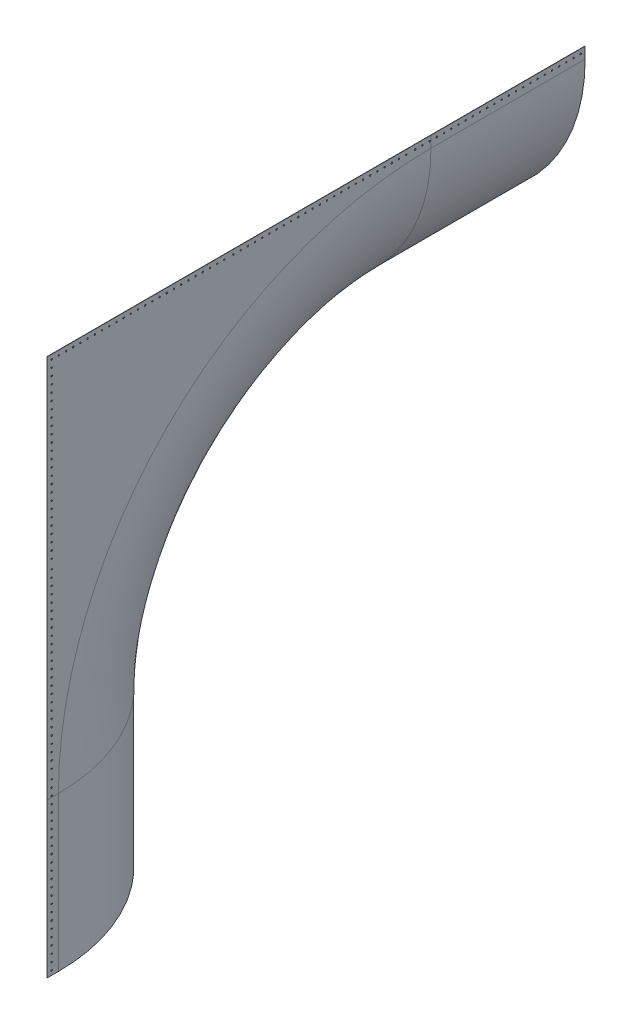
from build123d import *

# Parameters (mm, degrees)
BOSS_EXTRUDE1_DEPTH     = 1007.1377971
BOSS_EXTRUDE2_START     = -1.5875
BOSS_EXTRUDE2_DEPTH     = 1.5875
BOSS_EXTRUDE3_START     = 1006.9599971
BOSS_EXTRUDE3_DEPTH     = 1006.9599971
SKETCH11_R              = 4.826
CUT_EXTRUDE1_DEPTH      = 10
SKETCH13_W              = 4401.129844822
SKETCH13_H              = 2946.111508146
CUT_EXTRUDE2_DEPTH      = 4621.611456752
CUT_EXTRUDE3_DEPTH      = 4621.611456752
CUT_EXTRUDE3_DEPTH_BACK = 4621.611456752


with BuildPart() as part:
    # Sweep2: sweep along a path in Corner Arch
    with BuildLine(Plane.YZ) as sweep2_path:
        Line((0, 0), (0, 75.7422029))
        ThreePointArc((0, 75.7422029), (-731.881575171, 1842.660627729), (-2498.8, 2574.5422029))
        Line((-2498.8, 2574.5422029), (-2574.5422029, 2574.5422029))
    # sk 48.2in rad pnl → Sweep2 (sweep)
    with BuildSketch(Plane(origin=(0, 0, 0), x_dir=(0, 1, 0), z_dir=(0, 0, 1))):
        with BuildLine():
            Line((0, -1222.6925), (75.746594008, -1222.6925))
            Line((75.746594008, -1222.6925), (75.746594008, -1224.28))
            Line((75.746594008, -1224.28), (0, -1224.28))
            ThreePointArc((0, -1224.28), (-865.696690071, -865.696690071), (-1224.28, 0))
            Line((-1224.28, 0), (-1224.28, 75.737811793))
            Line((-1224.28, 75.737811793), (-1222.6925, 75.737811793))
            Line((-1222.6925, 75.737811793), (-1222.6925, 0))
            ThreePointArc((-1222.6925, 0), (-864.574158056, -864.574158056), (0, -1222.6925))
        make_face()
    sweep(path=sweep2_path.line)

    # Lower profile → Boss-Extrude1 (add)
    with BuildSketch(Plane(origin=(0, 0, 0), x_dir=(1, 0, 0), z_dir=(0, 0, -1))):
        with BuildLine():
            Line((-75.737811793, 1224.28), (0, 1224.28))
            ThreePointArc((0, 1224.28), (865.696690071, 865.696690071), (1224.28, 0))
            Line((1224.28, 0), (1224.28, -75.746594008))
            Line((1224.28, -75.746594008), (1222.6925, -75.746594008))
            Line((1222.6925, -75.746594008), (1222.6925, 0))
            ThreePointArc((1222.6925, 0), (864.574158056, 864.574158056), (0, 1222.6925))
            Line((0, 1222.6925), (-75.737811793, 1222.6925))
            Line((-75.737811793, 1222.6925), (-75.737811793, 1224.28))
        make_face()
    extrude(amount=BOSS_EXTRUDE1_DEPTH)

    # Sketch9 → Boss-Extrude2 (add)
    with BuildSketch(Plane.YZ.offset(1224.28).offset(BOSS_EXTRUDE2_START)):
        with BuildLine():
            Line((75.746594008, 75.7422029), (75.746594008, 2650.288796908))
            Line((75.746594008, 2650.288796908), (-2498.8, 2650.288796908))
            ThreePointArc((-2498.8, 2650.288796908), (-678.320644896, 1896.221558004), (75.746594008, 75.7422029))
        make_face()
    extrude(amount=BOSS_EXTRUDE2_DEPTH)

    # Sketch12 → Boss-Extrude3 (add)
    with BuildSketch(Plane.XZ.offset(2574.5422029).offset(BOSS_EXTRUDE3_START)):
        with BuildLine():
            Line((1224.28, 2650.288796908), (1224.28, 2574.5422029))
            ThreePointArc((1224.28, 2574.5422029), (865.696690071, 1708.845512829), (0, 1350.2622029))
            Line((0, 1350.2622029), (-75.737811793, 1350.2622029))
            Line((-75.737811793, 1350.2622029), (-75.737811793, 1351.8497029))
            Line((-75.737811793, 1351.8497029), (0, 1351.8497029))
            ThreePointArc((0, 1351.8497029), (864.574158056, 1709.968044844), (1222.6925, 2574.5422029))
            Line((1222.6925, 2574.5422029), (1222.6925, 2650.288796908))
            Line((1222.6925, 2650.288796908), (1224.28, 2650.288796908))
        make_face()
    extrude(amount=-BOSS_EXTRUDE3_DEPTH)

    # Sketch11 → Cut-Extrude1 (cut)
    with BuildSketch(Plane.YZ.offset(1224.28)):
        with Locations(Location((45.262199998, 1400.604402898, 0), (0, 0, 270))):
            Circle(SKETCH11_R)
        with Locations(Location((45.262199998, 1352.344402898, 0), (0, 0, 270))):
            Circle(SKETCH11_R)
        with Locations(Location((45.262199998, 1304.084402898, 0), (0, 0, 270))):
            Circle(SKETCH11_R)
        with Locations(Location((45.262199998, 1255.824402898, 0), (0, 0, 270))):
            Circle(SKETCH11_R)
        with Locations(Location((45.262199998, 1207.564402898, 0), (0, 0, 270))):
            Circle(SKETCH11_R)
        with Locations(Location((45.262199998, 1159.304402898, 0), (0, 0, 270))):
            Circle(SKETCH11_R)
        with Locations(Location((45.262199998, 1111.044402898, 0), (0, 0, 270))):
            Circle(SKETCH11_R)
        with Locations(Location((45.262199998, 1062.784402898, 0), (0, 0, 270))):
            Circle(SKETCH11_R)
        with Locations(Location((45.262199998, 1014.524402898, 0), (0, 0, 270))):
            Circle(SKETCH11_R)
        with Locations(Location((45.262199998, 966.264402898, 0), (0, 0, 270))):
            Circle(SKETCH11_R)
        with Locations(Location((45.262199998, 918.004402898, 0), (0, 0, 270))):
            Circle(SKETCH11_R)
        with Locations(Location((45.262199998, 869.744402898, 0), (0, 0, 270))):
            Circle(SKETCH11_R)
        with Locations(Location((45.262199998, 821.484402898, 0), (0, 0, 270))):
            Circle(SKETCH11_R)
        with Locations(Location((45.262199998, 773.224402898, 0), (0, 0, 270))):
            Circle(SKETCH11_R)
        with Locations(Location((45.262199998, 724.964402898, 0), (0, 0, 270))):
            Circle(SKETCH11_R)
        with Locations(Location((45.262199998, 676.704402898, 0), (0, 0, 270))):
            Circle(SKETCH11_R)
        with Locations(Location((45.262199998, 628.444402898, 0), (0, 0, 270))):
            Circle(SKETCH11_R)
        with Locations(Location((45.262199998, 580.184402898, 0), (0, 0, 270))):
            Circle(SKETCH11_R)
        with Locations(Location((45.262199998, 531.924402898, 0), (0, 0, 270))):
            Circle(SKETCH11_R)
        with Locations(Location((45.262199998, 483.664402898, 0), (0, 0, 270))):
            Circle(SKETCH11_R)
        with Locations(Location((45.262199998, 435.404402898, 0), (0, 0, 270))):
            Circle(SKETCH11_R)
        with Locations(Location((45.262199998, 387.144402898, 0), (0, 0, 270))):
            Circle(SKETCH11_R)
        with Locations(Location((45.262199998, 338.884402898, 0), (0, 0, 270))):
            Circle(SKETCH11_R)
        with Locations(Location((45.262199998, 290.624402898, 0), (0, 0, 270))):
            Circle(SKETCH11_R)
        with Locations(Location((45.262199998, 242.364402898, 0), (0, 0, 270))):
            Circle(SKETCH11_R)
        with Locations(Location((-1173.937800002, 2619.804402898, 0), (0, 0, 270))):
            Circle(SKETCH11_R)
        with Locations(Location((-1222.197800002, 2619.804402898, 0), (0, 0, 270))):
            Circle(SKETCH11_R)
        with Locations(Location((-1270.457800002, 2619.804402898, 0), (0, 0, 270))):
            Circle(SKETCH11_R)
        with Locations(Location((-1318.717800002, 2619.804402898, 0), (0, 0, 270))):
            Circle(SKETCH11_R)
        with Locations(Location((-1366.977800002, 2619.804402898, 0), (0, 0, 270))):
            Circle(SKETCH11_R)
        with Locations(Location((-1415.237800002, 2619.804402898, 0), (0, 0, 270))):
            Circle(SKETCH11_R)
        with Locations(Location((-1463.497800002, 2619.804402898, 0), (0, 0, 270))):
            Circle(SKETCH11_R)
        with Locations(Location((-1511.757800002, 2619.804402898, 0), (0, 0, 270))):
            Circle(SKETCH11_R)
        with Locations(Location((-1560.017800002, 2619.804402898, 0), (0, 0, 270))):
            Circle(SKETCH11_R)
        with Locations(Location((-1608.277800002, 2619.804402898, 0), (0, 0, 270))):
            Circle(SKETCH11_R)
        with Locations(Location((-1656.537800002, 2619.804402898, 0), (0, 0, 270))):
            Circle(SKETCH11_R)
        with Locations(Location((-1704.797800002, 2619.804402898, 0), (0, 0, 270))):
            Circle(SKETCH11_R)
        with Locations(Location((-1753.057800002, 2619.804402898, 0), (0, 0, 270))):
            Circle(SKETCH11_R)
        with Locations(Location((-1801.317800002, 2619.804402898, 0), (0, 0, 270))):
            Circle(SKETCH11_R)
        with Locations(Location((-1849.577800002, 2619.804402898, 0), (0, 0, 270))):
            Circle(SKETCH11_R)
        with Locations(Location((-1897.837800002, 2619.804402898, 0), (0, 0, 270))):
            Circle(SKETCH11_R)
        with Locations(Location((-1946.097800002, 2619.804402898, 0), (0, 0, 270))):
            Circle(SKETCH11_R)
        with Locations(Location((-1994.357800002, 2619.804402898, 0), (0, 0, 270))):
            Circle(SKETCH11_R)
        with Locations(Location((-2042.617800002, 2619.804402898, 0), (0, 0, 270))):
            Circle(SKETCH11_R)
        with Locations(Location((-2090.877800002, 2619.804402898, 0), (0, 0, 270))):
            Circle(SKETCH11_R)
        with Locations(Location((-2139.137800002, 2619.804402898, 0), (0, 0, 270))):
            Circle(SKETCH11_R)
        with Locations(Location((-2187.397800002, 2619.804402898, 0), (0, 0, 270))):
            Circle(SKETCH11_R)
        with Locations(Location((-2235.657800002, 2619.804402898, 0), (0, 0, 270))):
            Circle(SKETCH11_R)
        with Locations(Location((-2283.917800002, 2619.804402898, 0), (0, 0, 270))):
            Circle(SKETCH11_R)
        with Locations(Location((-2332.177800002, 2619.804402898, 0), (0, 0, 270))):
            Circle(SKETCH11_R)
        with Locations(Location((-2393.137800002, 2619.804402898, 0), (0, 0, 270))):
            Circle(SKETCH11_R)
        with Locations(Location((-2441.397800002, 2619.804402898, 0), (0, 0, 270))):
            Circle(SKETCH11_R)
        with Locations(Location((-2489.657800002, 2619.804402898, 0), (0, 0, 270))):
            Circle(SKETCH11_R)
        with Locations(Location((-2537.917800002, 2619.804402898, 0), (0, 0, 270))):
            Circle(SKETCH11_R)
        with Locations(Location((-2586.177800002, 2619.804402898, 0), (0, 0, 270))):
            Circle(SKETCH11_R)
        with Locations(Location((-2634.437800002, 2619.804402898, 0), (0, 0, 270))):
            Circle(SKETCH11_R)
        with Locations(Location((-2682.697800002, 2619.804402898, 0), (0, 0, 270))):
            Circle(SKETCH11_R)
        with Locations(Location((-2730.957800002, 2619.804402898, 0), (0, 0, 270))):
            Circle(SKETCH11_R)
        with Locations(Location((-2779.217800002, 2619.804402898, 0), (0, 0, 270))):
            Circle(SKETCH11_R)
        with Locations(Location((-2827.477800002, 2619.804402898, 0), (0, 0, 270))):
            Circle(SKETCH11_R)
        with Locations(Location((-2875.737800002, 2619.804402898, 0), (0, 0, 270))):
            Circle(SKETCH11_R)
        with Locations(Location((-2923.997800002, 2619.804402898, 0), (0, 0, 270))):
            Circle(SKETCH11_R)
        with Locations(Location((-2972.257800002, 2619.804402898, 0), (0, 0, 270))):
            Circle(SKETCH11_R)
        with Locations(Location((-3020.517800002, 2619.804402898, 0), (0, 0, 270))):
            Circle(SKETCH11_R)
        with Locations(Location((-3068.777800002, 2619.804402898, 0), (0, 0, 270))):
            Circle(SKETCH11_R)
        with Locations(Location((-3117.037800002, 2619.804402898, 0), (0, 0, 270))):
            Circle(SKETCH11_R)
        with Locations(Location((-3165.297800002, 2619.804402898, 0), (0, 0, 270))):
            Circle(SKETCH11_R)
        with Locations(Location((-3213.557800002, 2619.804402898, 0), (0, 0, 270))):
            Circle(SKETCH11_R)
        with Locations(Location((-3261.817800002, 2619.804402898, 0), (0, 0, 270))):
            Circle(SKETCH11_R)
        with Locations(Location((-3310.077800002, 2619.804402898, 0), (0, 0, 270))):
            Circle(SKETCH11_R)
        with Locations(Location((-3358.337800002, 2619.804402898, 0), (0, 0, 270))):
            Circle(SKETCH11_R)
        with Locations(Location((-3406.597800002, 2619.804402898, 0), (0, 0, 270))):
            Circle(SKETCH11_R)
        with Locations(Location((-3454.857800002, 2619.804402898, 0), (0, 0, 270))):
            Circle(SKETCH11_R)
        with Locations(Location((-3503.117800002, 2619.804402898, 0), (0, 0, 270))):
            Circle(SKETCH11_R)
        with Locations(Location((-3551.377800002, 2619.804402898, 0), (0, 0, 270))):
            Circle(SKETCH11_R)
        with Locations(Location((45.262199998, 181.404402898, 0), (0, 0, 270))):
            Circle(SKETCH11_R)
        with Locations(Location((45.262199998, 133.144402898, 0), (0, 0, 270))):
            Circle(SKETCH11_R)
        with Locations(Location((45.262199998, 84.884402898, 0), (0, 0, 270))):
            Circle(SKETCH11_R)
        with Locations(Location((45.262199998, 36.624402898, 0), (0, 0, 270))):
            Circle(SKETCH11_R)
        with Locations(Location((45.262199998, -11.635597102, 0), (0, 0, 270))):
            Circle(SKETCH11_R)
        with Locations(Location((45.262199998, -59.895597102, 0), (0, 0, 270))):
            Circle(SKETCH11_R)
        with Locations(Location((45.262199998, -108.155597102, 0), (0, 0, 270))):
            Circle(SKETCH11_R)
        with Locations(Location((45.262199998, -156.415597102, 0), (0, 0, 270))):
            Circle(SKETCH11_R)
        with Locations(Location((45.262199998, -204.675597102, 0), (0, 0, 270))):
            Circle(SKETCH11_R)
        with Locations(Location((45.262199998, -252.935597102, 0), (0, 0, 270))):
            Circle(SKETCH11_R)
        with Locations(Location((45.262199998, -301.195597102, 0), (0, 0, 270))):
            Circle(SKETCH11_R)
        with Locations(Location((45.262199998, -349.455597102, 0), (0, 0, 270))):
            Circle(SKETCH11_R)
        with Locations(Location((45.262199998, -397.715597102, 0), (0, 0, 270))):
            Circle(SKETCH11_R)
        with Locations(Location((45.262199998, -445.975597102, 0), (0, 0, 270))):
            Circle(SKETCH11_R)
        with Locations(Location((45.262199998, -494.235597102, 0), (0, 0, 270))):
            Circle(SKETCH11_R)
        with Locations(Location((45.262199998, -542.495597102, 0), (0, 0, 270))):
            Circle(SKETCH11_R)
        with Locations(Location((45.262199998, -590.755597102, 0), (0, 0, 270))):
            Circle(SKETCH11_R)
        with Locations(Location((45.262199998, -639.015597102, 0), (0, 0, 270))):
            Circle(SKETCH11_R)
        with Locations(Location((45.262199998, -687.275597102, 0), (0, 0, 270))):
            Circle(SKETCH11_R)
        with Locations(Location((45.262199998, -735.535597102, 0), (0, 0, 270))):
            Circle(SKETCH11_R)
        with Locations(Location((45.262199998, -783.795597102, 0), (0, 0, 270))):
            Circle(SKETCH11_R)
        with Locations(Location((45.262199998, -832.055597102, 0), (0, 0, 270))):
            Circle(SKETCH11_R)
        with Locations(Location((45.262199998, -880.315597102, 0), (0, 0, 270))):
            Circle(SKETCH11_R)
        with Locations(Location((45.262199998, -928.575597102, 0), (0, 0, 270))):
            Circle(SKETCH11_R)
        with Locations(Location((45.262199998, -976.835597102, 0), (0, 0, 270))):
            Circle(SKETCH11_R)
        with Locations(Location((45.262199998, 2619.804402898, 0), (0, 0, 270))):
            Circle(SKETCH11_R)
        with Locations(Location((-2.997800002, 2619.804402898, 0), (0, 0, 270))):
            Circle(SKETCH11_R)
        with Locations(Location((-51.257800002, 2619.804402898, 0), (0, 0, 270))):
            Circle(SKETCH11_R)
        with Locations(Location((-99.517800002, 2619.804402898, 0), (0, 0, 270))):
            Circle(SKETCH11_R)
        with Locations(Location((-147.777800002, 2619.804402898, 0), (0, 0, 270))):
            Circle(SKETCH11_R)
        with Locations(Location((-196.037800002, 2619.804402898, 0), (0, 0, 270))):
            Circle(SKETCH11_R)
        with Locations(Location((-244.297800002, 2619.804402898, 0), (0, 0, 270))):
            Circle(SKETCH11_R)
        with Locations(Location((-292.557800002, 2619.804402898, 0), (0, 0, 270))):
            Circle(SKETCH11_R)
        with Locations(Location((-340.817800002, 2619.804402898, 0), (0, 0, 270))):
            Circle(SKETCH11_R)
        with Locations(Location((-389.077800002, 2619.804402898, 0), (0, 0, 270))):
            Circle(SKETCH11_R)
        with Locations(Location((-437.337800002, 2619.804402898, 0), (0, 0, 270))):
            Circle(SKETCH11_R)
        with Locations(Location((-485.597800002, 2619.804402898, 0), (0, 0, 270))):
            Circle(SKETCH11_R)
        with Locations(Location((-533.857800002, 2619.804402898, 0), (0, 0, 270))):
            Circle(SKETCH11_R)
        with Locations(Location((-582.117800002, 2619.804402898, 0), (0, 0, 270))):
            Circle(SKETCH11_R)
        with Locations(Location((-630.377800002, 2619.804402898, 0), (0, 0, 270))):
            Circle(SKETCH11_R)
        with Locations(Location((-678.637800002, 2619.804402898, 0), (0, 0, 270))):
            Circle(SKETCH11_R)
        with Locations(Location((-726.897800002, 2619.804402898, 0), (0, 0, 270))):
            Circle(SKETCH11_R)
        with Locations(Location((-775.157800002, 2619.804402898, 0), (0, 0, 270))):
            Circle(SKETCH11_R)
        with Locations(Location((-823.417800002, 2619.804402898, 0), (0, 0, 270))):
            Circle(SKETCH11_R)
        with Locations(Location((-871.677800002, 2619.804402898, 0), (0, 0, 270))):
            Circle(SKETCH11_R)
        with Locations(Location((-919.937800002, 2619.804402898, 0), (0, 0, 270))):
            Circle(SKETCH11_R)
        with Locations(Location((-968.197800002, 2619.804402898, 0), (0, 0, 270))):
            Circle(SKETCH11_R)
        with Locations(Location((-1016.457800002, 2619.804402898, 0), (0, 0, 270))):
            Circle(SKETCH11_R)
        with Locations(Location((-1064.717800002, 2619.804402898, 0), (0, 0, 270))):
            Circle(SKETCH11_R)
        with Locations(Location((-1112.977800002, 2619.804402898, 0), (0, 0, 270))):
            Circle(SKETCH11_R)
        with Locations(Location((45.262199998, 2571.544402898, 0), (0, 0, 270))):
            Circle(SKETCH11_R)
        with Locations(Location((45.262199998, 2523.284402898, 0), (0, 0, 270))):
            Circle(SKETCH11_R)
        with Locations(Location((45.262199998, 2475.024402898, 0), (0, 0, 270))):
            Circle(SKETCH11_R)
        with Locations(Location((45.262199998, 2426.764402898, 0), (0, 0, 270))):
            Circle(SKETCH11_R)
        with Locations(Location((45.262199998, 2378.504402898, 0), (0, 0, 270))):
            Circle(SKETCH11_R)
        with Locations(Location((45.262199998, 2330.244402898, 0), (0, 0, 270))):
            Circle(SKETCH11_R)
        with Locations(Location((45.262199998, 2281.984402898, 0), (0, 0, 270))):
            Circle(SKETCH11_R)
        with Locations(Location((45.262199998, 2233.724402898, 0), (0, 0, 270))):
            Circle(SKETCH11_R)
        with Locations(Location((45.262199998, 2185.464402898, 0), (0, 0, 270))):
            Circle(SKETCH11_R)
        with Locations(Location((45.262199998, 2137.204402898, 0), (0, 0, 270))):
            Circle(SKETCH11_R)
        with Locations(Location((45.262199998, 2088.944402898, 0), (0, 0, 270))):
            Circle(SKETCH11_R)
        with Locations(Location((45.262199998, 2040.684402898, 0), (0, 0, 270))):
            Circle(SKETCH11_R)
        with Locations(Location((45.262199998, 1992.424402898, 0), (0, 0, 270))):
            Circle(SKETCH11_R)
        with Locations(Location((45.262199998, 1944.164402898, 0), (0, 0, 270))):
            Circle(SKETCH11_R)
        with Locations(Location((45.262199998, 1895.904402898, 0), (0, 0, 270))):
            Circle(SKETCH11_R)
        with Locations(Location((45.262199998, 1847.644402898, 0), (0, 0, 270))):
            Circle(SKETCH11_R)
        with Locations(Location((45.262199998, 1799.384402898, 0), (0, 0, 270))):
            Circle(SKETCH11_R)
        with Locations(Location((45.262199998, 1751.124402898, 0), (0, 0, 270))):
            Circle(SKETCH11_R)
        with Locations(Location((45.262199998, 1702.864402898, 0), (0, 0, 270))):
            Circle(SKETCH11_R)
        with Locations(Location((45.262199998, 1654.604402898, 0), (0, 0, 270))):
            Circle(SKETCH11_R)
        with Locations(Location((45.262199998, 1606.344402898, 0), (0, 0, 270))):
            Circle(SKETCH11_R)
        with Locations(Location((45.262199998, 1558.084402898, 0), (0, 0, 270))):
            Circle(SKETCH11_R)
        with Locations(Location((45.262199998, 1509.824402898, 0), (0, 0, 270))):
            Circle(SKETCH11_R)
        with Locations(Location((45.262199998, 1461.564402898, 0), (0, 0, 270))):
            Circle(SKETCH11_R)
    extrude(amount=-CUT_EXTRUDE1_DEPTH, mode=Mode.SUBTRACT)

    # Sketch13 → Cut-Extrude2 (cut, through all)
    with BuildSketch(Plane.YZ):
        with Locations((-1891.164669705, 365.740285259)):
            Rectangle(SKETCH13_W, SKETCH13_H)
    extrude(amount=-CUT_EXTRUDE2_DEPTH, mode=Mode.SUBTRACT)

    # Sketch14 → Cut-Extrude3 (cut, two sides: drawn at the far end of the back side and taken through both)
    with BuildSketch(Plane.YZ.offset(-CUT_EXTRUDE3_DEPTH_BACK)):
        Polygon((-3958.436958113, 2838.149337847), (-3532.15, 2838.149337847), (-3532.15, -957.7855971), (231.615542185, -957.7855971), (231.615542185, -1221.495322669), (-3958.436958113, -1221.495322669), align=None)
    extrude(amount=CUT_EXTRUDE3_DEPTH + CUT_EXTRUDE3_DEPTH_BACK, mode=Mode.SUBTRACT)


solid = part.part
